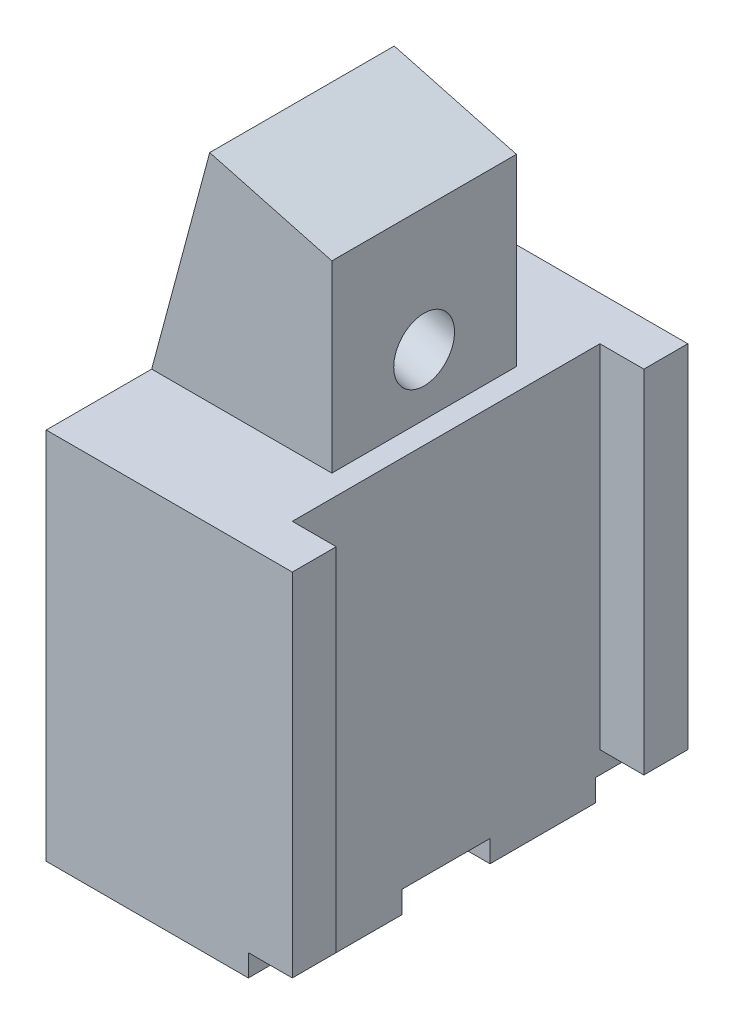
ISO-10303-21;
HEADER;
FILE_DESCRIPTION(('STEP AP214'),'2;1');
FILE_NAME('part.step','',(''),(''),'','','');
FILE_SCHEMA(('AUTOMOTIVE_DESIGN { 1 0 10303 214 1 1 1 1 }'));
ENDSEC;
DATA;
#1=APPLICATION_CONTEXT('core data for automotive mechanical design processes');
#2=APPLICATION_PROTOCOL_DEFINITION('international standard','automotive_design',2000,#1);
#3=PRODUCT_CONTEXT('',#1,'mechanical');
#4=PRODUCT('Part','Part','',(#3));
#5=PRODUCT_RELATED_PRODUCT_CATEGORY('part','',(#4));
#6=PRODUCT_DEFINITION_FORMATION('','',#4);
#7=PRODUCT_DEFINITION_CONTEXT('part definition',#1,'design');
#8=PRODUCT_DEFINITION('design','',#6,#7);
#9=PRODUCT_DEFINITION_SHAPE('','',#8);
#10=(LENGTH_UNIT() NAMED_UNIT(*) SI_UNIT(.MILLI.,.METRE.));
#11=(NAMED_UNIT(*) PLANE_ANGLE_UNIT() SI_UNIT($,.RADIAN.));
#12=(NAMED_UNIT(*) SI_UNIT($,.STERADIAN.) SOLID_ANGLE_UNIT());
#13=UNCERTAINTY_MEASURE_WITH_UNIT(LENGTH_MEASURE(1.E-05),#10,'distance_accuracy_value','');
#14=(GEOMETRIC_REPRESENTATION_CONTEXT(3) GLOBAL_UNCERTAINTY_ASSIGNED_CONTEXT((#13)) GLOBAL_UNIT_ASSIGNED_CONTEXT((#10,
#11,#12)) REPRESENTATION_CONTEXT('',''));
#15=CARTESIAN_POINT('',(0.,0.,0.));
#16=DIRECTION('',(0.,0.,1.));
#17=DIRECTION('',(1.,0.,0.));
#18=AXIS2_PLACEMENT_3D('',#15,#16,#17);
#19=CARTESIAN_POINT('',(39.5184601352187,-16.3379848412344,0.));
#20=DIRECTION('',(0.,-1.,0.));
#21=DIRECTION('',(0.,0.,-1.));
#22=AXIS2_PLACEMENT_3D('',#19,#20,#21);
#23=PLANE('',#22);
#24=DIRECTION('',(1.,0.,0.));
#25=VECTOR('',#24,1.);
#26=CARTESIAN_POINT('',(11.0381339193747,-16.3379848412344,90.));
#27=LINE('',#26,#25);
#28=CARTESIAN_POINT('',(29.5184601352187,-16.3379848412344,90.));
#29=VERTEX_POINT('',#28);
#30=CARTESIAN_POINT('',(39.5184601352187,-16.3379848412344,90.));
#31=VERTEX_POINT('',#30);
#32=EDGE_CURVE('E283',#29,#31,#27,.T.);
#33=ORIENTED_EDGE('',*,*,#32,.F.);
#34=DIRECTION('',(0.,0.,-1.));
#35=VECTOR('',#34,1.);
#36=CARTESIAN_POINT('',(29.5184601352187,-16.3379848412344,0.));
#37=LINE('',#36,#35);
#38=CARTESIAN_POINT('',(29.5184601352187,-16.3379848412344,80.));
#39=VERTEX_POINT('',#38);
#40=EDGE_CURVE('E275',#39,#29,#37,.F.);
#41=ORIENTED_EDGE('',*,*,#40,.F.);
#42=DIRECTION('',(1.,0.,0.));
#43=VECTOR('',#42,1.);
#44=CARTESIAN_POINT('',(39.5184601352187,-16.3379848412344,80.));
#45=LINE('',#44,#43);
#46=CARTESIAN_POINT('',(39.5184601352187,-16.3379848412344,80.));
#47=VERTEX_POINT('',#46);
#48=EDGE_CURVE('E257',#39,#47,#45,.T.);
#49=ORIENTED_EDGE('',*,*,#48,.T.);
#50=DIRECTION('',(0.,0.,-1.));
#51=VECTOR('',#50,1.);
#52=CARTESIAN_POINT('',(39.5184601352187,-16.3379848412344,0.));
#53=LINE('',#52,#51);
#54=EDGE_CURVE('E98',#31,#47,#53,.T.);
#55=ORIENTED_EDGE('',*,*,#54,.F.);
#56=EDGE_LOOP('',(#33,#41,#49,#55));
#57=FACE_BOUND('',#56,.T.);
#58=ADVANCED_FACE('F16',(#57),#23,.T.);
#59=CARTESIAN_POINT('',(-3.27732489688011,112.940816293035,0.));
#60=DIRECTION('',(0.25881904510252,0.965925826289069,0.));
#61=DIRECTION('',(-0.965925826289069,0.25881904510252,0.));
#62=AXIS2_PLACEMENT_3D('',#59,#60,#61);
#63=PLANE('',#62);
#64=DIRECTION('',(0.,0.,1.));
#65=VECTOR('',#64,1.);
#66=CARTESIAN_POINT('',(-3.27732489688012,112.940816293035,0.));
#67=LINE('',#66,#65);
#68=CARTESIAN_POINT('',(-3.27732489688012,112.940816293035,66.));
#69=VERTEX_POINT('',#68);
#70=CARTESIAN_POINT('',(-3.27732489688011,112.940816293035,24.));
#71=VERTEX_POINT('',#70);
#72=EDGE_CURVE('E226',#69,#71,#67,.F.);
#73=ORIENTED_EDGE('',*,*,#72,.F.);
#74=DIRECTION('',(-0.965925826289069,0.25881904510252,0.));
#75=VECTOR('',#74,1.);
#76=CARTESIAN_POINT('',(-3.27732489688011,112.940816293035,66.));
#77=LINE('',#76,#75);
#78=CARTESIAN_POINT('',(24.5184601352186,105.492958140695,66.));
#79=VERTEX_POINT('',#78);
#80=EDGE_CURVE('E86',#69,#79,#77,.F.);
#81=ORIENTED_EDGE('',*,*,#80,.T.);
#82=DIRECTION('',(0.,0.,-1.));
#83=VECTOR('',#82,1.);
#84=CARTESIAN_POINT('',(24.5184601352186,105.492958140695,45.));
#85=LINE('',#84,#83);
#86=CARTESIAN_POINT('',(24.5184601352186,105.492958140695,24.));
#87=VERTEX_POINT('',#86);
#88=EDGE_CURVE('E234',#87,#79,#85,.F.);
#89=ORIENTED_EDGE('',*,*,#88,.F.);
#90=DIRECTION('',(-0.965925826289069,0.258819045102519,0.));
#91=VECTOR('',#90,1.);
#92=CARTESIAN_POINT('',(24.5184601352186,105.492958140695,24.));
#93=LINE('',#92,#91);
#94=EDGE_CURVE('E238',#87,#71,#93,.T.);
#95=ORIENTED_EDGE('',*,*,#94,.T.);
#96=EDGE_LOOP('',(#73,#81,#89,#95));
#97=FACE_BOUND('',#96,.T.);
#98=ADVANCED_FACE('F400',(#97),#63,.T.);
#99=CARTESIAN_POINT('',(-11.9403307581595,87.2918301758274,45.));
#100=DIRECTION('',(0.965925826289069,-0.25881904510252,0.));
#101=DIRECTION('',(0.25881904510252,0.965925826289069,0.));
#102=AXIS2_PLACEMENT_3D('',#99,#100,#101);
#103=CYLINDRICAL_SURFACE('',#102,6.9175);
#104=CARTESIAN_POINT('',(-10.2698827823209,86.8442349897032,45.));
#105=DIRECTION('',(0.965925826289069,-0.25881904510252,0.));
#106=DIRECTION('',(0.25881904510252,0.965925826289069,0.));
#107=AXIS2_PLACEMENT_3D('',#104,#105,#106);
#108=CIRCLE('',#107,6.9175);
#109=CARTESIAN_POINT('',(-8.47950203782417,93.5260268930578,45.));
#110=VERTEX_POINT('',#109);
#111=EDGE_CURVE('E241',#110,#110,#108,.T.);
#112=ORIENTED_EDGE('',*,*,#111,.F.);
#113=EDGE_LOOP('',(#112));
#114=FACE_BOUND('',#113,.T.);
#115=CARTESIAN_POINT('',(24.5184601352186,77.5227265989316,45.));
#116=DIRECTION('',(1.,0.,0.));
#117=DIRECTION('',(0.,-1.,0.));
#118=AXIS2_PLACEMENT_3D('',#115,#116,#117);
#119=ELLIPSE('',#118,7.16152297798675,6.9175);
#120=CARTESIAN_POINT('',(24.5184601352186,70.3612036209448,45.));
#121=VERTEX_POINT('',#120);
#122=EDGE_CURVE('E20',#121,#121,#119,.F.);
#123=ORIENTED_EDGE('',*,*,#122,.F.);
#124=EDGE_LOOP('',(#123));
#125=FACE_BOUND('',#124,.T.);
#126=ADVANCED_FACE('F428',(#114,#125),#103,.F.);
#127=CARTESIAN_POINT('',(39.5184601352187,-16.3379848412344,9.99999999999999));
#128=DIRECTION('',(0.,0.,-1.));
#129=DIRECTION('',(-1.,0.,0.));
#130=AXIS2_PLACEMENT_3D('',#127,#128,#129);
#131=PLANE('',#130);
#132=DIRECTION('',(1.,0.,0.));
#133=VECTOR('',#132,1.);
#134=CARTESIAN_POINT('',(39.5184601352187,-16.3379848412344,9.99999999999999));
#135=LINE('',#134,#133);
#136=CARTESIAN_POINT('',(39.5184601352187,-16.3379848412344,9.99999999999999));
#137=VERTEX_POINT('',#136);
#138=CARTESIAN_POINT('',(29.5184601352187,-16.3379848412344,9.99999999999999));
#139=VERTEX_POINT('',#138);
#140=EDGE_CURVE('E260',#137,#139,#135,.F.);
#141=ORIENTED_EDGE('',*,*,#140,.F.);
#142=DIRECTION('',(0.,1.,0.));
#143=VECTOR('',#142,1.);
#144=CARTESIAN_POINT('',(39.5184601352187,63.6620151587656,10.));
#145=LINE('',#144,#143);
#146=CARTESIAN_POINT('',(39.5184601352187,63.6620151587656,10.));
#147=VERTEX_POINT('',#146);
#148=EDGE_CURVE('E264',#147,#137,#145,.F.);
#149=ORIENTED_EDGE('',*,*,#148,.F.);
#150=DIRECTION('',(1.,0.,0.));
#151=VECTOR('',#150,1.);
#152=CARTESIAN_POINT('',(29.5184601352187,63.6620151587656,10.));
#153=LINE('',#152,#151);
#154=CARTESIAN_POINT('',(29.5184601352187,63.6620151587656,9.99999999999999));
#155=VERTEX_POINT('',#154);
#156=EDGE_CURVE('E243',#155,#147,#153,.T.);
#157=ORIENTED_EDGE('',*,*,#156,.F.);
#158=DIRECTION('',(0.,1.,0.));
#159=VECTOR('',#158,1.);
#160=CARTESIAN_POINT('',(29.5184601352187,-16.3379848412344,9.99999999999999));
#161=LINE('',#160,#159);
#162=EDGE_CURVE('E174',#139,#155,#161,.T.);
#163=ORIENTED_EDGE('',*,*,#162,.F.);
#164=EDGE_LOOP('',(#141,#149,#157,#163));
#165=FACE_BOUND('',#164,.T.);
#166=ADVANCED_FACE('F393',(#165),#131,.F.);
#167=CARTESIAN_POINT('',(8.3782574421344,84.6625131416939,24.));
#168=DIRECTION('',(0.,0.,1.));
#169=DIRECTION('',(1.,0.,0.));
#170=AXIS2_PLACEMENT_3D('',#167,#168,#169);
#171=PLANE('',#170);
#172=DIRECTION('',(1.,0.,0.));
#173=VECTOR('',#172,1.);
#174=CARTESIAN_POINT('',(29.5184601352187,63.6620151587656,24.));
#175=LINE('',#174,#173);
#176=CARTESIAN_POINT('',(-16.4815398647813,63.6620151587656,24.));
#177=VERTEX_POINT('',#176);
#178=CARTESIAN_POINT('',(24.5184601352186,63.6620151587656,24.));
#179=VERTEX_POINT('',#178);
#180=EDGE_CURVE('E312',#177,#179,#175,.T.);
#181=ORIENTED_EDGE('',*,*,#180,.F.);
#182=DIRECTION('',(-0.25881904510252,-0.965925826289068,0.));
#183=VECTOR('',#182,1.);
#184=CARTESIAN_POINT('',(-16.4815398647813,63.6620151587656,24.));
#185=LINE('',#184,#183);
#186=EDGE_CURVE('E229',#71,#177,#185,.T.);
#187=ORIENTED_EDGE('',*,*,#186,.F.);
#188=ORIENTED_EDGE('',*,*,#94,.F.);
#189=DIRECTION('',(0.,1.,0.));
#190=VECTOR('',#189,1.);
#191=CARTESIAN_POINT('',(24.5184601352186,87.4982312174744,24.));
#192=LINE('',#191,#190);
#193=EDGE_CURVE('E237',#179,#87,#192,.T.);
#194=ORIENTED_EDGE('',*,*,#193,.F.);
#195=EDGE_LOOP('',(#181,#187,#188,#194));
#196=FACE_BOUND('',#195,.T.);
#197=ADVANCED_FACE('F403',(#196),#171,.F.);
#198=CARTESIAN_POINT('',(24.5184601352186,87.4982312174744,45.));
#199=DIRECTION('',(1.,0.,0.));
#200=DIRECTION('',(0.,0.,-1.));
#201=AXIS2_PLACEMENT_3D('',#198,#199,#200);
#202=PLANE('',#201);
#203=ORIENTED_EDGE('',*,*,#122,.T.);
#204=EDGE_LOOP('',(#203));
#205=FACE_BOUND('',#204,.T.);
#206=DIRECTION('',(0.,0.,1.));
#207=VECTOR('',#206,1.);
#208=CARTESIAN_POINT('',(24.5184601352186,63.6620151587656,0.));
#209=LINE('',#208,#207);
#210=CARTESIAN_POINT('',(24.5184601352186,63.6620151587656,66.));
#211=VERTEX_POINT('',#210);
#212=EDGE_CURVE('E309',#179,#211,#209,.T.);
#213=ORIENTED_EDGE('',*,*,#212,.F.);
#214=ORIENTED_EDGE('',*,*,#193,.T.);
#215=ORIENTED_EDGE('',*,*,#88,.T.);
#216=DIRECTION('',(0.,-1.,0.));
#217=VECTOR('',#216,1.);
#218=CARTESIAN_POINT('',(24.5184601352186,88.3014157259,66.));
#219=LINE('',#218,#217);
#220=EDGE_CURVE('E239',#79,#211,#219,.T.);
#221=ORIENTED_EDGE('',*,*,#220,.T.);
#222=EDGE_LOOP('',(#213,#214,#215,#221));
#223=FACE_BOUND('',#222,.T.);
#224=ADVANCED_FACE('F412',(#205,#223),#202,.T.);
#225=CARTESIAN_POINT('',(-16.4815398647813,112.940816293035,66.));
#226=DIRECTION('',(0.,0.,-1.));
#227=DIRECTION('',(1.,0.,0.));
#228=AXIS2_PLACEMENT_3D('',#225,#226,#227);
#229=PLANE('',#228);
#230=ORIENTED_EDGE('',*,*,#80,.F.);
#231=DIRECTION('',(-0.25881904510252,-0.965925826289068,0.));
#232=VECTOR('',#231,1.);
#233=CARTESIAN_POINT('',(-16.4815398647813,63.6620151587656,66.));
#234=LINE('',#233,#232);
#235=CARTESIAN_POINT('',(-16.4815398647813,63.6620151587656,66.));
#236=VERTEX_POINT('',#235);
#237=EDGE_CURVE('E230',#236,#69,#234,.F.);
#238=ORIENTED_EDGE('',*,*,#237,.F.);
#239=DIRECTION('',(1.,0.,0.));
#240=VECTOR('',#239,1.);
#241=CARTESIAN_POINT('',(29.5184601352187,63.6620151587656,66.));
#242=LINE('',#241,#240);
#243=EDGE_CURVE('E306',#211,#236,#242,.F.);
#244=ORIENTED_EDGE('',*,*,#243,.F.);
#245=ORIENTED_EDGE('',*,*,#220,.F.);
#246=EDGE_LOOP('',(#230,#238,#244,#245));
#247=FACE_BOUND('',#246,.T.);
#248=ADVANCED_FACE('F18',(#247),#229,.F.);
#249=CARTESIAN_POINT('',(39.5184601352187,63.6620151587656,0.));
#250=DIRECTION('',(1.,0.,0.));
#251=DIRECTION('',(0.,0.,-1.));
#252=AXIS2_PLACEMENT_3D('',#249,#250,#251);
#253=PLANE('',#252);
#254=DIRECTION('',(0.,1.,0.));
#255=VECTOR('',#254,1.);
#256=CARTESIAN_POINT('',(39.5184601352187,38.2509201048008,90.));
#257=LINE('',#256,#255);
#258=CARTESIAN_POINT('',(39.5184601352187,63.6620151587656,90.));
#259=VERTEX_POINT('',#258);
#260=EDGE_CURVE('E233',#31,#259,#257,.T.);
#261=ORIENTED_EDGE('',*,*,#260,.F.);
#262=ORIENTED_EDGE('',*,*,#54,.T.);
#263=DIRECTION('',(0.,1.,0.));
#264=VECTOR('',#263,1.);
#265=CARTESIAN_POINT('',(39.5184601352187,63.6620151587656,80.));
#266=LINE('',#265,#264);
#267=CARTESIAN_POINT('',(39.5184601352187,63.6620151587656,80.));
#268=VERTEX_POINT('',#267);
#269=EDGE_CURVE('E258',#47,#268,#266,.T.);
#270=ORIENTED_EDGE('',*,*,#269,.T.);
#271=DIRECTION('',(0.,0.,1.));
#272=VECTOR('',#271,1.);
#273=CARTESIAN_POINT('',(39.5184601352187,63.6620151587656,0.));
#274=LINE('',#273,#272);
#275=EDGE_CURVE('E300',#259,#268,#274,.F.);
#276=ORIENTED_EDGE('',*,*,#275,.F.);
#277=EDGE_LOOP('',(#261,#262,#270,#276));
#278=FACE_BOUND('',#277,.T.);
#279=ADVANCED_FACE('F418',(#278),#253,.T.);
#280=CARTESIAN_POINT('',(39.5184601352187,63.6620151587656,80.));
#281=DIRECTION('',(0.,0.,1.));
#282=DIRECTION('',(1.,0.,0.));
#283=AXIS2_PLACEMENT_3D('',#280,#281,#282);
#284=PLANE('',#283);
#285=DIRECTION('',(1.,0.,0.));
#286=VECTOR('',#285,1.);
#287=CARTESIAN_POINT('',(29.5184601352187,63.6620151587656,80.));
#288=LINE('',#287,#286);
#289=CARTESIAN_POINT('',(29.5184601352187,63.6620151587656,80.));
#290=VERTEX_POINT('',#289);
#291=EDGE_CURVE('E297',#268,#290,#288,.F.);
#292=ORIENTED_EDGE('',*,*,#291,.F.);
#293=ORIENTED_EDGE('',*,*,#269,.F.);
#294=ORIENTED_EDGE('',*,*,#48,.F.);
#295=DIRECTION('',(0.,1.,0.));
#296=VECTOR('',#295,1.);
#297=CARTESIAN_POINT('',(29.5184601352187,-16.3379848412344,80.));
#298=LINE('',#297,#296);
#299=EDGE_CURVE('E268',#290,#39,#298,.F.);
#300=ORIENTED_EDGE('',*,*,#299,.F.);
#301=EDGE_LOOP('',(#292,#293,#294,#300));
#302=FACE_BOUND('',#301,.T.);
#303=ADVANCED_FACE('F482',(#302),#284,.F.);
#304=CARTESIAN_POINT('',(39.5184601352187,-16.3379848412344,0.));
#305=DIRECTION('',(0.,-1.,0.));
#306=DIRECTION('',(0.,0.,-1.));
#307=AXIS2_PLACEMENT_3D('',#304,#305,#306);
#308=PLANE('',#307);
#309=DIRECTION('',(1.,0.,0.));
#310=VECTOR('',#309,1.);
#311=CARTESIAN_POINT('',(11.0381339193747,-16.3379848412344,0.));
#312=LINE('',#311,#310);
#313=CARTESIAN_POINT('',(29.5184601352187,-16.3379848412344,0.));
#314=VERTEX_POINT('',#313);
#315=CARTESIAN_POINT('',(39.5184601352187,-16.3379848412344,0.));
#316=VERTEX_POINT('',#315);
#317=EDGE_CURVE('E325',#314,#316,#312,.T.);
#318=ORIENTED_EDGE('',*,*,#317,.T.);
#319=DIRECTION('',(0.,0.,-1.));
#320=VECTOR('',#319,1.);
#321=CARTESIAN_POINT('',(39.5184601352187,-16.3379848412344,0.));
#322=LINE('',#321,#320);
#323=EDGE_CURVE('E265',#137,#316,#322,.T.);
#324=ORIENTED_EDGE('',*,*,#323,.F.);
#325=ORIENTED_EDGE('',*,*,#140,.T.);
#326=DIRECTION('',(0.,0.,-1.));
#327=VECTOR('',#326,1.);
#328=CARTESIAN_POINT('',(29.5184601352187,-16.3379848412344,0.));
#329=LINE('',#328,#327);
#330=EDGE_CURVE('E273',#314,#139,#329,.F.);
#331=ORIENTED_EDGE('',*,*,#330,.F.);
#332=EDGE_LOOP('',(#318,#324,#325,#331));
#333=FACE_BOUND('',#332,.T.);
#334=ADVANCED_FACE('F383',(#333),#308,.T.);
#335=CARTESIAN_POINT('',(39.5184601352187,63.6620151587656,0.));
#336=DIRECTION('',(1.,0.,0.));
#337=DIRECTION('',(0.,0.,-1.));
#338=AXIS2_PLACEMENT_3D('',#335,#336,#337);
#339=PLANE('',#338);
#340=DIRECTION('',(0.,1.,0.));
#341=VECTOR('',#340,1.);
#342=CARTESIAN_POINT('',(39.5184601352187,38.2509201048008,0.));
#343=LINE('',#342,#341);
#344=CARTESIAN_POINT('',(39.5184601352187,63.6620151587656,0.));
#345=VERTEX_POINT('',#344);
#346=EDGE_CURVE('E323',#316,#345,#343,.T.);
#347=ORIENTED_EDGE('',*,*,#346,.T.);
#348=DIRECTION('',(0.,0.,1.));
#349=VECTOR('',#348,1.);
#350=CARTESIAN_POINT('',(39.5184601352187,63.6620151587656,0.));
#351=LINE('',#350,#349);
#352=EDGE_CURVE('E315',#147,#345,#351,.F.);
#353=ORIENTED_EDGE('',*,*,#352,.F.);
#354=ORIENTED_EDGE('',*,*,#148,.T.);
#355=ORIENTED_EDGE('',*,*,#323,.T.);
#356=EDGE_LOOP('',(#347,#353,#354,#355));
#357=FACE_BOUND('',#356,.T.);
#358=ADVANCED_FACE('F386',(#357),#339,.T.);
#359=CARTESIAN_POINT('',(29.5184601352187,-16.3379848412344,0.));
#360=DIRECTION('',(1.,0.,0.));
#361=DIRECTION('',(0.,0.,-1.));
#362=AXIS2_PLACEMENT_3D('',#359,#360,#361);
#363=PLANE('',#362);
#364=ORIENTED_EDGE('',*,*,#330,.T.);
#365=ORIENTED_EDGE('',*,*,#162,.T.);
#366=DIRECTION('',(0.,0.,1.));
#367=VECTOR('',#366,1.);
#368=CARTESIAN_POINT('',(29.5184601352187,63.6620151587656,0.));
#369=LINE('',#368,#367);
#370=EDGE_CURVE('E293',#290,#155,#369,.F.);
#371=ORIENTED_EDGE('',*,*,#370,.F.);
#372=ORIENTED_EDGE('',*,*,#299,.T.);
#373=ORIENTED_EDGE('',*,*,#40,.T.);
#374=DIRECTION('',(0.,1.,0.));
#375=VECTOR('',#374,1.);
#376=CARTESIAN_POINT('',(29.5184601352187,38.2509201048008,90.));
#377=LINE('',#376,#375);
#378=CARTESIAN_POINT('',(29.5184601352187,-21.3379848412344,90.));
#379=VERTEX_POINT('',#378);
#380=EDGE_CURVE('E286',#379,#29,#377,.T.);
#381=ORIENTED_EDGE('',*,*,#380,.F.);
#382=DIRECTION('',(0.,0.,1.));
#383=VECTOR('',#382,1.);
#384=CARTESIAN_POINT('',(29.5184601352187,-21.3379848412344,90.));
#385=LINE('',#384,#383);
#386=CARTESIAN_POINT('',(29.5184601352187,-21.3379848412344,79.));
#387=VERTEX_POINT('',#386);
#388=EDGE_CURVE('E170',#379,#387,#385,.F.);
#389=ORIENTED_EDGE('',*,*,#388,.T.);
#390=DIRECTION('',(0.,1.,0.));
#391=VECTOR('',#390,1.);
#392=CARTESIAN_POINT('',(29.5184601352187,-21.3379848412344,79.));
#393=LINE('',#392,#391);
#394=CARTESIAN_POINT('',(29.5184601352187,-26.3379848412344,79.));
#395=VERTEX_POINT('',#394);
#396=EDGE_CURVE('E163',#387,#395,#393,.F.);
#397=ORIENTED_EDGE('',*,*,#396,.T.);
#398=DIRECTION('',(0.,0.,-1.));
#399=VECTOR('',#398,1.);
#400=CARTESIAN_POINT('',(29.5184601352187,-26.3379848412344,0.));
#401=LINE('',#400,#399);
#402=CARTESIAN_POINT('',(29.5184601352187,-26.3379848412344,55.));
#403=VERTEX_POINT('',#402);
#404=EDGE_CURVE('E168',#403,#395,#401,.F.);
#405=ORIENTED_EDGE('',*,*,#404,.F.);
#406=DIRECTION('',(0.,1.,0.));
#407=VECTOR('',#406,1.);
#408=CARTESIAN_POINT('',(29.5184601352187,-26.3379848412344,55.));
#409=LINE('',#408,#407);
#410=CARTESIAN_POINT('',(29.5184601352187,-21.3379848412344,55.));
#411=VERTEX_POINT('',#410);
#412=EDGE_CURVE('E157',#403,#411,#409,.T.);
#413=ORIENTED_EDGE('',*,*,#412,.T.);
#414=DIRECTION('',(0.,0.,1.));
#415=VECTOR('',#414,1.);
#416=CARTESIAN_POINT('',(29.5184601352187,-21.3379848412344,55.));
#417=LINE('',#416,#415);
#418=CARTESIAN_POINT('',(29.5184601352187,-21.3379848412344,35.));
#419=VERTEX_POINT('',#418);
#420=EDGE_CURVE('E349',#411,#419,#417,.F.);
#421=ORIENTED_EDGE('',*,*,#420,.T.);
#422=DIRECTION('',(0.,1.,0.));
#423=VECTOR('',#422,1.);
#424=CARTESIAN_POINT('',(29.5184601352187,-21.3379848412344,35.));
#425=LINE('',#424,#423);
#426=CARTESIAN_POINT('',(29.5184601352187,-26.3379848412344,35.));
#427=VERTEX_POINT('',#426);
#428=EDGE_CURVE('E344',#419,#427,#425,.F.);
#429=ORIENTED_EDGE('',*,*,#428,.T.);
#430=DIRECTION('',(0.,0.,-1.));
#431=VECTOR('',#430,1.);
#432=CARTESIAN_POINT('',(29.5184601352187,-26.3379848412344,0.));
#433=LINE('',#432,#431);
#434=CARTESIAN_POINT('',(29.5184601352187,-26.3379848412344,11.));
#435=VERTEX_POINT('',#434);
#436=EDGE_CURVE('E339',#435,#427,#433,.F.);
#437=ORIENTED_EDGE('',*,*,#436,.F.);
#438=DIRECTION('',(0.,1.,0.));
#439=VECTOR('',#438,1.);
#440=CARTESIAN_POINT('',(29.5184601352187,-26.3379848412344,11.));
#441=LINE('',#440,#439);
#442=CARTESIAN_POINT('',(29.5184601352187,-21.3379848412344,11.));
#443=VERTEX_POINT('',#442);
#444=EDGE_CURVE('E334',#435,#443,#441,.T.);
#445=ORIENTED_EDGE('',*,*,#444,.T.);
#446=DIRECTION('',(0.,0.,1.));
#447=VECTOR('',#446,1.);
#448=CARTESIAN_POINT('',(29.5184601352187,-21.3379848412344,11.));
#449=LINE('',#448,#447);
#450=CARTESIAN_POINT('',(29.5184601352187,-21.3379848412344,0.));
#451=VERTEX_POINT('',#450);
#452=EDGE_CURVE('E329',#443,#451,#449,.F.);
#453=ORIENTED_EDGE('',*,*,#452,.T.);
#454=DIRECTION('',(0.,1.,0.));
#455=VECTOR('',#454,1.);
#456=CARTESIAN_POINT('',(29.5184601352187,38.2509201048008,0.));
#457=LINE('',#456,#455);
#458=EDGE_CURVE('E296',#451,#314,#457,.T.);
#459=ORIENTED_EDGE('',*,*,#458,.T.);
#460=EDGE_LOOP('',(#364,#365,#371,#372,#373,#381,#389,#397,#405,#413,#421,#429,#437,#445,#453,#459));
#461=FACE_BOUND('',#460,.T.);
#462=ADVANCED_FACE('F166',(#461),#363,.T.);
#463=CARTESIAN_POINT('',(-16.4815398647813,-21.3379848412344,79.));
#464=DIRECTION('',(0.,0.,-1.));
#465=DIRECTION('',(-1.,0.,0.));
#466=AXIS2_PLACEMENT_3D('',#463,#464,#465);
#467=PLANE('',#466);
#468=DIRECTION('',(1.,0.,0.));
#469=VECTOR('',#468,1.);
#470=CARTESIAN_POINT('',(-16.4815398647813,-21.3379848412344,79.));
#471=LINE('',#470,#469);
#472=CARTESIAN_POINT('',(-16.4815398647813,-21.3379848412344,79.));
#473=VERTEX_POINT('',#472);
#474=EDGE_CURVE('E173',#387,#473,#471,.F.);
#475=ORIENTED_EDGE('',*,*,#474,.T.);
#476=DIRECTION('',(0.,1.,0.));
#477=VECTOR('',#476,1.);
#478=CARTESIAN_POINT('',(-16.4815398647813,-26.3379848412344,79.));
#479=LINE('',#478,#477);
#480=CARTESIAN_POINT('',(-16.4815398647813,-26.3379848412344,79.));
#481=VERTEX_POINT('',#480);
#482=EDGE_CURVE('E180',#481,#473,#479,.T.);
#483=ORIENTED_EDGE('',*,*,#482,.F.);
#484=DIRECTION('',(1.,0.,0.));
#485=VECTOR('',#484,1.);
#486=CARTESIAN_POINT('',(29.5184601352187,-26.3379848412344,79.));
#487=LINE('',#486,#485);
#488=EDGE_CURVE('E177',#395,#481,#487,.F.);
#489=ORIENTED_EDGE('',*,*,#488,.F.);
#490=ORIENTED_EDGE('',*,*,#396,.F.);
#491=EDGE_LOOP('',(#475,#483,#489,#490));
#492=FACE_BOUND('',#491,.T.);
#493=ADVANCED_FACE('F178',(#492),#467,.F.);
#494=CARTESIAN_POINT('',(-16.4815398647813,-21.3379848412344,90.));
#495=DIRECTION('',(0.,1.,0.));
#496=DIRECTION('',(0.,0.,1.));
#497=AXIS2_PLACEMENT_3D('',#494,#495,#496);
#498=PLANE('',#497);
#499=DIRECTION('',(1.,0.,0.));
#500=VECTOR('',#499,1.);
#501=CARTESIAN_POINT('',(11.0381339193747,-21.3379848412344,90.));
#502=LINE('',#501,#500);
#503=CARTESIAN_POINT('',(-16.4815398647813,-21.3379848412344,90.));
#504=VERTEX_POINT('',#503);
#505=EDGE_CURVE('E280',#504,#379,#502,.T.);
#506=ORIENTED_EDGE('',*,*,#505,.F.);
#507=DIRECTION('',(0.,0.,1.));
#508=VECTOR('',#507,1.);
#509=CARTESIAN_POINT('',(-16.4815398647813,-21.3379848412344,0.));
#510=LINE('',#509,#508);
#511=EDGE_CURVE('E185',#473,#504,#510,.T.);
#512=ORIENTED_EDGE('',*,*,#511,.F.);
#513=ORIENTED_EDGE('',*,*,#474,.F.);
#514=ORIENTED_EDGE('',*,*,#388,.F.);
#515=EDGE_LOOP('',(#506,#512,#513,#514));
#516=FACE_BOUND('',#515,.T.);
#517=ADVANCED_FACE('F446',(#516),#498,.F.);
#518=CARTESIAN_POINT('',(11.0381339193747,38.2509201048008,90.));
#519=DIRECTION('',(0.,0.,1.));
#520=DIRECTION('',(1.,0.,0.));
#521=AXIS2_PLACEMENT_3D('',#518,#519,#520);
#522=PLANE('',#521);
#523=ORIENTED_EDGE('',*,*,#32,.T.);
#524=ORIENTED_EDGE('',*,*,#260,.T.);
#525=DIRECTION('',(1.,0.,0.));
#526=VECTOR('',#525,1.);
#527=CARTESIAN_POINT('',(29.5184601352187,63.6620151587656,90.));
#528=LINE('',#527,#526);
#529=CARTESIAN_POINT('',(-16.4815398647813,63.6620151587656,90.));
#530=VERTEX_POINT('',#529);
#531=EDGE_CURVE('E303',#530,#259,#528,.T.);
#532=ORIENTED_EDGE('',*,*,#531,.F.);
#533=DIRECTION('',(0.,1.,0.));
#534=VECTOR('',#533,1.);
#535=CARTESIAN_POINT('',(-16.4815398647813,-26.3379848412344,90.));
#536=LINE('',#535,#534);
#537=EDGE_CURVE('E221',#504,#530,#536,.T.);
#538=ORIENTED_EDGE('',*,*,#537,.F.);
#539=ORIENTED_EDGE('',*,*,#505,.T.);
#540=ORIENTED_EDGE('',*,*,#380,.T.);
#541=EDGE_LOOP('',(#523,#524,#532,#538,#539,#540));
#542=FACE_BOUND('',#541,.T.);
#543=ADVANCED_FACE('F440',(#542),#522,.T.);
#544=CARTESIAN_POINT('',(-16.4815398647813,63.6620151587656,0.));
#545=DIRECTION('',(-0.965925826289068,0.25881904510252,0.));
#546=DIRECTION('',(-0.25881904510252,-0.965925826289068,0.));
#547=AXIS2_PLACEMENT_3D('',#544,#545,#546);
#548=PLANE('',#547);
#549=ORIENTED_EDGE('',*,*,#111,.T.);
#550=EDGE_LOOP('',(#549));
#551=FACE_BOUND('',#550,.T.);
#552=ORIENTED_EDGE('',*,*,#186,.T.);
#553=DIRECTION('',(0.,0.,1.));
#554=VECTOR('',#553,1.);
#555=CARTESIAN_POINT('',(-16.4815398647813,63.6620151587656,0.));
#556=LINE('',#555,#554);
#557=EDGE_CURVE('E215',#236,#177,#556,.F.);
#558=ORIENTED_EDGE('',*,*,#557,.F.);
#559=ORIENTED_EDGE('',*,*,#237,.T.);
#560=ORIENTED_EDGE('',*,*,#72,.T.);
#561=EDGE_LOOP('',(#552,#558,#559,#560));
#562=FACE_BOUND('',#561,.T.);
#563=ADVANCED_FACE('F407',(#551,#562),#548,.T.);
#564=CARTESIAN_POINT('',(29.5184601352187,63.6620151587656,0.));
#565=DIRECTION('',(0.,1.,0.));
#566=DIRECTION('',(0.,0.,1.));
#567=AXIS2_PLACEMENT_3D('',#564,#565,#566);
#568=PLANE('',#567);
#569=ORIENTED_EDGE('',*,*,#291,.T.);
#570=ORIENTED_EDGE('',*,*,#370,.T.);
#571=ORIENTED_EDGE('',*,*,#156,.T.);
#572=ORIENTED_EDGE('',*,*,#352,.T.);
#573=DIRECTION('',(1.,0.,0.));
#574=VECTOR('',#573,1.);
#575=CARTESIAN_POINT('',(11.0381339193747,63.6620151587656,0.));
#576=LINE('',#575,#574);
#577=CARTESIAN_POINT('',(-16.4815398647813,63.6620151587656,0.));
#578=VERTEX_POINT('',#577);
#579=EDGE_CURVE('E320',#345,#578,#576,.F.);
#580=ORIENTED_EDGE('',*,*,#579,.T.);
#581=DIRECTION('',(0.,0.,1.));
#582=VECTOR('',#581,1.);
#583=CARTESIAN_POINT('',(-16.4815398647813,63.6620151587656,0.));
#584=LINE('',#583,#582);
#585=EDGE_CURVE('E212',#177,#578,#584,.F.);
#586=ORIENTED_EDGE('',*,*,#585,.F.);
#587=ORIENTED_EDGE('',*,*,#180,.T.);
#588=ORIENTED_EDGE('',*,*,#212,.T.);
#589=ORIENTED_EDGE('',*,*,#243,.T.);
#590=DIRECTION('',(0.,0.,1.));
#591=VECTOR('',#590,1.);
#592=CARTESIAN_POINT('',(-16.4815398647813,63.6620151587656,0.));
#593=LINE('',#592,#591);
#594=EDGE_CURVE('E218',#530,#236,#593,.F.);
#595=ORIENTED_EDGE('',*,*,#594,.F.);
#596=ORIENTED_EDGE('',*,*,#531,.T.);
#597=ORIENTED_EDGE('',*,*,#275,.T.);
#598=EDGE_LOOP('',(#569,#570,#571,#572,#580,#586,#587,#588,#589,#595,#596,#597));
#599=FACE_BOUND('',#598,.T.);
#600=ADVANCED_FACE('F411',(#599),#568,.T.);
#601=CARTESIAN_POINT('',(11.0381339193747,38.2509201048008,0.));
#602=DIRECTION('',(0.,0.,1.));
#603=DIRECTION('',(1.,0.,0.));
#604=AXIS2_PLACEMENT_3D('',#601,#602,#603);
#605=PLANE('',#604);
#606=ORIENTED_EDGE('',*,*,#346,.F.);
#607=ORIENTED_EDGE('',*,*,#317,.F.);
#608=ORIENTED_EDGE('',*,*,#458,.F.);
#609=DIRECTION('',(1.,0.,0.));
#610=VECTOR('',#609,1.);
#611=CARTESIAN_POINT('',(-16.4815398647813,-21.3379848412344,0.));
#612=LINE('',#611,#610);
#613=CARTESIAN_POINT('',(-16.4815398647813,-21.3379848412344,0.));
#614=VERTEX_POINT('',#613);
#615=EDGE_CURVE('E322',#451,#614,#612,.F.);
#616=ORIENTED_EDGE('',*,*,#615,.T.);
#617=DIRECTION('',(0.,1.,0.));
#618=VECTOR('',#617,1.);
#619=CARTESIAN_POINT('',(-16.4815398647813,-26.3379848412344,0.));
#620=LINE('',#619,#618);
#621=EDGE_CURVE('E209',#578,#614,#620,.F.);
#622=ORIENTED_EDGE('',*,*,#621,.F.);
#623=ORIENTED_EDGE('',*,*,#579,.F.);
#624=EDGE_LOOP('',(#606,#607,#608,#616,#622,#623));
#625=FACE_BOUND('',#624,.T.);
#626=ADVANCED_FACE('F379',(#625),#605,.F.);
#627=CARTESIAN_POINT('',(-16.4815398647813,-21.3379848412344,11.));
#628=DIRECTION('',(0.,1.,0.));
#629=DIRECTION('',(0.,0.,1.));
#630=AXIS2_PLACEMENT_3D('',#627,#628,#629);
#631=PLANE('',#630);
#632=DIRECTION('',(1.,0.,0.));
#633=VECTOR('',#632,1.);
#634=CARTESIAN_POINT('',(-16.4815398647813,-21.3379848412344,11.));
#635=LINE('',#634,#633);
#636=CARTESIAN_POINT('',(-16.4815398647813,-21.3379848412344,11.));
#637=VERTEX_POINT('',#636);
#638=EDGE_CURVE('E332',#443,#637,#635,.F.);
#639=ORIENTED_EDGE('',*,*,#638,.T.);
#640=DIRECTION('',(0.,0.,1.));
#641=VECTOR('',#640,1.);
#642=CARTESIAN_POINT('',(-16.4815398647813,-21.3379848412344,0.));
#643=LINE('',#642,#641);
#644=EDGE_CURVE('E206',#614,#637,#643,.T.);
#645=ORIENTED_EDGE('',*,*,#644,.F.);
#646=ORIENTED_EDGE('',*,*,#615,.F.);
#647=ORIENTED_EDGE('',*,*,#452,.F.);
#648=EDGE_LOOP('',(#639,#645,#646,#647));
#649=FACE_BOUND('',#648,.T.);
#650=ADVANCED_FACE('F373',(#649),#631,.F.);
#651=CARTESIAN_POINT('',(-16.4815398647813,-26.3379848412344,11.));
#652=DIRECTION('',(0.,0.,1.));
#653=DIRECTION('',(1.,0.,0.));
#654=AXIS2_PLACEMENT_3D('',#651,#652,#653);
#655=PLANE('',#654);
#656=DIRECTION('',(1.,0.,0.));
#657=VECTOR('',#656,1.);
#658=CARTESIAN_POINT('',(29.5184601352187,-26.3379848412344,11.));
#659=LINE('',#658,#657);
#660=CARTESIAN_POINT('',(-16.4815398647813,-26.3379848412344,11.));
#661=VERTEX_POINT('',#660);
#662=EDGE_CURVE('E337',#661,#435,#659,.T.);
#663=ORIENTED_EDGE('',*,*,#662,.F.);
#664=DIRECTION('',(0.,1.,0.));
#665=VECTOR('',#664,1.);
#666=CARTESIAN_POINT('',(-16.4815398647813,-26.3379848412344,11.));
#667=LINE('',#666,#665);
#668=EDGE_CURVE('E203',#637,#661,#667,.F.);
#669=ORIENTED_EDGE('',*,*,#668,.F.);
#670=ORIENTED_EDGE('',*,*,#638,.F.);
#671=ORIENTED_EDGE('',*,*,#444,.F.);
#672=EDGE_LOOP('',(#663,#669,#670,#671));
#673=FACE_BOUND('',#672,.T.);
#674=ADVANCED_FACE('F370',(#673),#655,.F.);
#675=CARTESIAN_POINT('',(29.5184601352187,-26.3379848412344,0.));
#676=DIRECTION('',(0.,-1.,0.));
#677=DIRECTION('',(0.,0.,-1.));
#678=AXIS2_PLACEMENT_3D('',#675,#676,#677);
#679=PLANE('',#678);
#680=DIRECTION('',(-1.,0.,0.));
#681=VECTOR('',#680,1.);
#682=CARTESIAN_POINT('',(-16.4815398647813,-26.3379848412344,35.));
#683=LINE('',#682,#681);
#684=CARTESIAN_POINT('',(-16.4815398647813,-26.3379848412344,35.));
#685=VERTEX_POINT('',#684);
#686=EDGE_CURVE('E341',#427,#685,#683,.T.);
#687=ORIENTED_EDGE('',*,*,#686,.T.);
#688=DIRECTION('',(0.,0.,1.));
#689=VECTOR('',#688,1.);
#690=CARTESIAN_POINT('',(-16.4815398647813,-26.3379848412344,0.));
#691=LINE('',#690,#689);
#692=EDGE_CURVE('E200',#661,#685,#691,.T.);
#693=ORIENTED_EDGE('',*,*,#692,.F.);
#694=ORIENTED_EDGE('',*,*,#662,.T.);
#695=ORIENTED_EDGE('',*,*,#436,.T.);
#696=EDGE_LOOP('',(#687,#693,#694,#695));
#697=FACE_BOUND('',#696,.T.);
#698=ADVANCED_FACE('F367',(#697),#679,.T.);
#699=CARTESIAN_POINT('',(-16.4815398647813,-21.3379848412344,35.));
#700=DIRECTION('',(0.,0.,-1.));
#701=DIRECTION('',(-1.,0.,0.));
#702=AXIS2_PLACEMENT_3D('',#699,#700,#701);
#703=PLANE('',#702);
#704=DIRECTION('',(1.,0.,0.));
#705=VECTOR('',#704,1.);
#706=CARTESIAN_POINT('',(-16.4815398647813,-21.3379848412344,35.));
#707=LINE('',#706,#705);
#708=CARTESIAN_POINT('',(-16.4815398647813,-21.3379848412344,35.));
#709=VERTEX_POINT('',#708);
#710=EDGE_CURVE('E347',#419,#709,#707,.F.);
#711=ORIENTED_EDGE('',*,*,#710,.T.);
#712=DIRECTION('',(0.,1.,0.));
#713=VECTOR('',#712,1.);
#714=CARTESIAN_POINT('',(-16.4815398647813,-26.3379848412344,35.));
#715=LINE('',#714,#713);
#716=EDGE_CURVE('E197',#685,#709,#715,.T.);
#717=ORIENTED_EDGE('',*,*,#716,.F.);
#718=ORIENTED_EDGE('',*,*,#686,.F.);
#719=ORIENTED_EDGE('',*,*,#428,.F.);
#720=EDGE_LOOP('',(#711,#717,#718,#719));
#721=FACE_BOUND('',#720,.T.);
#722=ADVANCED_FACE('F363',(#721),#703,.F.);
#723=CARTESIAN_POINT('',(-16.4815398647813,-21.3379848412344,55.));
#724=DIRECTION('',(0.,1.,0.));
#725=DIRECTION('',(0.,0.,1.));
#726=AXIS2_PLACEMENT_3D('',#723,#724,#725);
#727=PLANE('',#726);
#728=DIRECTION('',(1.,0.,0.));
#729=VECTOR('',#728,1.);
#730=CARTESIAN_POINT('',(-16.4815398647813,-21.3379848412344,55.));
#731=LINE('',#730,#729);
#732=CARTESIAN_POINT('',(-16.4815398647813,-21.3379848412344,55.));
#733=VERTEX_POINT('',#732);
#734=EDGE_CURVE('E189',#411,#733,#731,.F.);
#735=ORIENTED_EDGE('',*,*,#734,.T.);
#736=DIRECTION('',(0.,0.,1.));
#737=VECTOR('',#736,1.);
#738=CARTESIAN_POINT('',(-16.4815398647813,-21.3379848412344,0.));
#739=LINE('',#738,#737);
#740=EDGE_CURVE('E194',#709,#733,#739,.T.);
#741=ORIENTED_EDGE('',*,*,#740,.F.);
#742=ORIENTED_EDGE('',*,*,#710,.F.);
#743=ORIENTED_EDGE('',*,*,#420,.F.);
#744=EDGE_LOOP('',(#735,#741,#742,#743));
#745=FACE_BOUND('',#744,.T.);
#746=ADVANCED_FACE('F354',(#745),#727,.F.);
#747=CARTESIAN_POINT('',(-16.4815398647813,-26.3379848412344,55.));
#748=DIRECTION('',(0.,0.,1.));
#749=DIRECTION('',(1.,0.,0.));
#750=AXIS2_PLACEMENT_3D('',#747,#748,#749);
#751=PLANE('',#750);
#752=DIRECTION('',(1.,0.,0.));
#753=VECTOR('',#752,1.);
#754=CARTESIAN_POINT('',(29.5184601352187,-26.3379848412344,55.));
#755=LINE('',#754,#753);
#756=CARTESIAN_POINT('',(-16.4815398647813,-26.3379848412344,55.));
#757=VERTEX_POINT('',#756);
#758=EDGE_CURVE('E35',#757,#403,#755,.T.);
#759=ORIENTED_EDGE('',*,*,#758,.F.);
#760=DIRECTION('',(0.,1.,0.));
#761=VECTOR('',#760,1.);
#762=CARTESIAN_POINT('',(-16.4815398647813,-26.3379848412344,55.));
#763=LINE('',#762,#761);
#764=EDGE_CURVE('E26',#733,#757,#763,.F.);
#765=ORIENTED_EDGE('',*,*,#764,.F.);
#766=ORIENTED_EDGE('',*,*,#734,.F.);
#767=ORIENTED_EDGE('',*,*,#412,.F.);
#768=EDGE_LOOP('',(#759,#765,#766,#767));
#769=FACE_BOUND('',#768,.T.);
#770=ADVANCED_FACE('F356',(#769),#751,.F.);
#771=CARTESIAN_POINT('',(29.5184601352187,-26.3379848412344,0.));
#772=DIRECTION('',(0.,-1.,0.));
#773=DIRECTION('',(0.,0.,-1.));
#774=AXIS2_PLACEMENT_3D('',#771,#772,#773);
#775=PLANE('',#774);
#776=ORIENTED_EDGE('',*,*,#758,.T.);
#777=ORIENTED_EDGE('',*,*,#404,.T.);
#778=ORIENTED_EDGE('',*,*,#488,.T.);
#779=DIRECTION('',(0.,0.,1.));
#780=VECTOR('',#779,1.);
#781=CARTESIAN_POINT('',(-16.4815398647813,-26.3379848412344,0.));
#782=LINE('',#781,#780);
#783=EDGE_CURVE('E10',#757,#481,#782,.T.);
#784=ORIENTED_EDGE('',*,*,#783,.F.);
#785=EDGE_LOOP('',(#776,#777,#778,#784));
#786=FACE_BOUND('',#785,.T.);
#787=ADVANCED_FACE('F183',(#786),#775,.T.);
#788=CARTESIAN_POINT('',(-16.4815398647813,-26.3379848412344,0.));
#789=DIRECTION('',(-1.,0.,0.));
#790=DIRECTION('',(0.,0.,1.));
#791=AXIS2_PLACEMENT_3D('',#788,#789,#790);
#792=PLANE('',#791);
#793=ORIENTED_EDGE('',*,*,#764,.T.);
#794=ORIENTED_EDGE('',*,*,#783,.T.);
#795=ORIENTED_EDGE('',*,*,#482,.T.);
#796=ORIENTED_EDGE('',*,*,#511,.T.);
#797=ORIENTED_EDGE('',*,*,#537,.T.);
#798=ORIENTED_EDGE('',*,*,#594,.T.);
#799=ORIENTED_EDGE('',*,*,#557,.T.);
#800=ORIENTED_EDGE('',*,*,#585,.T.);
#801=ORIENTED_EDGE('',*,*,#621,.T.);
#802=ORIENTED_EDGE('',*,*,#644,.T.);
#803=ORIENTED_EDGE('',*,*,#668,.T.);
#804=ORIENTED_EDGE('',*,*,#692,.T.);
#805=ORIENTED_EDGE('',*,*,#716,.T.);
#806=ORIENTED_EDGE('',*,*,#740,.T.);
#807=EDGE_LOOP('',(#793,#794,#795,#796,#797,#798,#799,#800,#801,#802,#803,#804,#805,#806));
#808=FACE_BOUND('',#807,.T.);
#809=ADVANCED_FACE('F358',(#808),#792,.T.);
#810=CLOSED_SHELL('',(#58,#98,#126,#166,#197,#224,#248,#279,#303,#334,#358,#462,#493,#517,#543,
#563,#600,#626,#650,#674,#698,#722,#746,#770,#787,#809));
#811=MANIFOLD_SOLID_BREP('B1',#810);
#812=ADVANCED_BREP_SHAPE_REPRESENTATION('',(#18,#811),#14);
#813=SHAPE_DEFINITION_REPRESENTATION(#9,#812);
ENDSEC;
END-ISO-10303-21;
